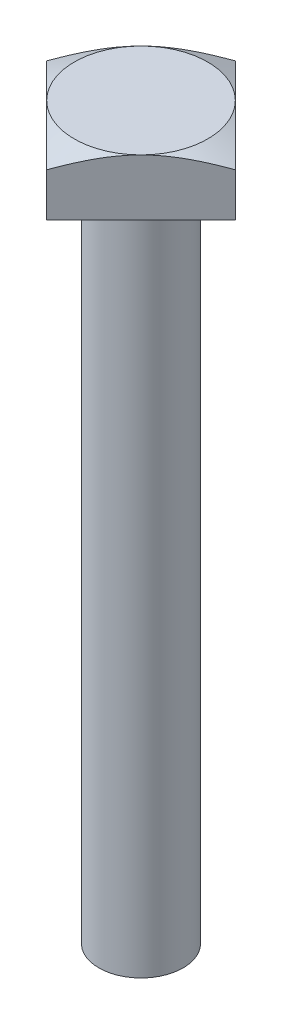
ISO-10303-21;
HEADER;
FILE_DESCRIPTION(('STEP AP214'),'2;1');
FILE_NAME('part.step','',(''),(''),'','','');
FILE_SCHEMA(('AUTOMOTIVE_DESIGN { 1 0 10303 214 1 1 1 1 }'));
ENDSEC;
DATA;
#1=APPLICATION_CONTEXT('core data for automotive mechanical design processes');
#2=APPLICATION_PROTOCOL_DEFINITION('international standard','automotive_design',2000,#1);
#3=PRODUCT_CONTEXT('',#1,'mechanical');
#4=PRODUCT('Part','Part','',(#3));
#5=PRODUCT_RELATED_PRODUCT_CATEGORY('part','',(#4));
#6=PRODUCT_DEFINITION_FORMATION('','',#4);
#7=PRODUCT_DEFINITION_CONTEXT('part definition',#1,'design');
#8=PRODUCT_DEFINITION('design','',#6,#7);
#9=PRODUCT_DEFINITION_SHAPE('','',#8);
#10=(LENGTH_UNIT() NAMED_UNIT(*) SI_UNIT(.MILLI.,.METRE.));
#11=(NAMED_UNIT(*) PLANE_ANGLE_UNIT() SI_UNIT($,.RADIAN.));
#12=(NAMED_UNIT(*) SI_UNIT($,.STERADIAN.) SOLID_ANGLE_UNIT());
#13=UNCERTAINTY_MEASURE_WITH_UNIT(LENGTH_MEASURE(1.E-05),#10,'distance_accuracy_value','');
#14=(GEOMETRIC_REPRESENTATION_CONTEXT(3) GLOBAL_UNCERTAINTY_ASSIGNED_CONTEXT((#13)) GLOBAL_UNIT_ASSIGNED_CONTEXT((#10,
#11,#12)) REPRESENTATION_CONTEXT('',''));
#15=CARTESIAN_POINT('',(0.,0.,0.));
#16=DIRECTION('',(0.,0.,1.));
#17=DIRECTION('',(1.,0.,0.));
#18=AXIS2_PLACEMENT_3D('',#15,#16,#17);
#19=CARTESIAN_POINT('',(-6.71751442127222,8.,6.7175144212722));
#20=DIRECTION('',(0.707106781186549,0.,-0.707106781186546));
#21=DIRECTION('',(-0.707106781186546,0.,-0.707106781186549));
#22=AXIS2_PLACEMENT_3D('',#19,#20,#21);
#23=PLANE('',#22);
#24=CARTESIAN_POINT('',(-13.4352288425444,6.16497265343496,-0.000200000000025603));
#25=CARTESIAN_POINT('',(-13.3017456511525,6.22721514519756,0.13328319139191));
#26=CARTESIAN_POINT('',(-13.1680687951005,6.28862605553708,0.266960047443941));
#27=CARTESIAN_POINT('',(-12.9002922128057,6.40959600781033,0.534736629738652));
#28=CARTESIAN_POINT('',(-12.7661924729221,6.4691549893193,0.668836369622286));
#29=CARTESIAN_POINT('',(-12.3631160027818,6.64480969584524,1.07191283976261));
#30=CARTESIAN_POINT('',(-12.0934640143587,6.75783530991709,1.34156482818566));
#31=CARTESIAN_POINT('',(-11.5502282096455,6.97460002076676,1.88480063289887));
#32=CARTESIAN_POINT('',(-11.276630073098,7.07826774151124,2.15839876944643));
#33=CARTESIAN_POINT('',(-10.7272245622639,7.2730933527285,2.70780428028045));
#34=CARTESIAN_POINT('',(-10.4514174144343,7.36425250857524,2.98361142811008));
#35=CARTESIAN_POINT('',(-9.90722658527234,7.52846190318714,3.52780225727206));
#36=CARTESIAN_POINT('',(-9.63892271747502,7.60203602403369,3.79610612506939));
#37=CARTESIAN_POINT('',(-9.10026726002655,7.73247535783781,4.33476158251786));
#38=CARTESIAN_POINT('',(-8.82991568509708,7.78934069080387,4.60511315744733));
#39=CARTESIAN_POINT('',(-8.28845512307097,7.88372305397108,5.14657371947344));
#40=CARTESIAN_POINT('',(-8.01735201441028,7.92130650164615,5.41767682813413));
#41=CARTESIAN_POINT('',(-7.47409196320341,7.97550795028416,5.96093687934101));
#42=CARTESIAN_POINT('',(-7.20193505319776,7.99212659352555,6.23309378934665));
#43=CARTESIAN_POINT('',(-6.64035879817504,8.00381053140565,6.79467004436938));
#44=CARTESIAN_POINT('',(-6.35092398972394,7.9974633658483,7.08410485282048));
#45=CARTESIAN_POINT('',(-5.77283538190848,7.9604375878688,7.66219346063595));
#46=CARTESIAN_POINT('',(-5.48418162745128,7.92975760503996,7.95084721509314));
#47=CARTESIAN_POINT('',(-4.90745724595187,7.84576792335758,8.52757159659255));
#48=CARTESIAN_POINT('',(-4.61939289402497,7.79237355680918,8.81563594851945));
#49=CARTESIAN_POINT('',(-4.04548269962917,7.6657482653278,9.38954614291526));
#50=CARTESIAN_POINT('',(-3.75963689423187,7.59251700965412,9.67539194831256));
#51=CARTESIAN_POINT('',(-3.17940837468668,7.42618843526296,10.2556204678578));
#52=CARTESIAN_POINT('',(-2.88512085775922,7.33243463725,10.5499079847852));
#53=CARTESIAN_POINT('',(-2.29907698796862,7.13018858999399,11.1359518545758));
#54=CARTESIAN_POINT('',(-2.00732096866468,7.02169442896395,11.4277078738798));
#55=CARTESIAN_POINT('',(-1.42837159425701,6.79371107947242,12.0066572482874));
#56=CARTESIAN_POINT('',(-1.14116041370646,6.67431182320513,12.293868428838));
#57=CARTESIAN_POINT('',(-0.711956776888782,6.48819914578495,12.7230720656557));
#58=CARTESIAN_POINT('',(-0.569192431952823,6.42500891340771,12.8658364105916));
#59=CARTESIAN_POINT('',(-0.284145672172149,6.29651698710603,13.1508831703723));
#60=CARTESIAN_POINT('',(-0.141863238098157,6.23121537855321,13.2931656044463));
#61=CARTESIAN_POINT('',(0.00019999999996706,6.16497265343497,13.4352288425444));
#62=B_SPLINE_CURVE_WITH_KNOTS('',3,(#24,#25,#26,#27,#28,#29,#30,#31,#32,#33,#34,#35,#36,#37,#38,
#39,#40,#41,#42,#43,#44,#45,#46,#47,#48,#49,#50,#51,#52,#53,#54,#55,#56,#57,#58,#59,#60,#61),
.UNSPECIFIED.,.F.,.F.,(4,2,2,2,2,2,2,2,2,2,2,2,2,2,2,2,2,2,4),(0.,0.596307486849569,
1.19263440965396,2.38574409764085,3.58729682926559,4.78872792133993,5.94793047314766,
7.10712469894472,8.26229874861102,9.41743740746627,10.6447946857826,11.8722210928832,
13.1042633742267,14.3363261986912,15.6158392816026,16.8955184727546,18.1654616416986,
18.8001232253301,19.4347591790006),.UNSPECIFIED.);
#63=CARTESIAN_POINT('',(-13.4350288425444,6.16506591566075,0.));
#64=VERTEX_POINT('',#63);
#65=CARTESIAN_POINT('',(-6.71751442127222,8.,6.71751442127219));
#66=VERTEX_POINT('',#65);
#67=EDGE_CURVE('E98',#64,#66,#62,.T.);
#68=ORIENTED_EDGE('',*,*,#67,.F.);
#69=DIRECTION('',(0.,-1.,0.));
#70=VECTOR('',#69,1.);
#71=CARTESIAN_POINT('',(-13.4350288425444,8.,0.));
#72=LINE('',#71,#70);
#73=CARTESIAN_POINT('',(-13.4350288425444,0.,0.));
#74=VERTEX_POINT('',#73);
#75=EDGE_CURVE('E178',#64,#74,#72,.T.);
#76=ORIENTED_EDGE('',*,*,#75,.T.);
#77=DIRECTION('',(0.707106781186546,0.,0.707106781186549));
#78=VECTOR('',#77,1.);
#79=CARTESIAN_POINT('',(-6.71751442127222,0.,6.7175144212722));
#80=LINE('',#79,#78);
#81=CARTESIAN_POINT('',(0.,0.,13.4350288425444));
#82=VERTEX_POINT('',#81);
#83=EDGE_CURVE('E173',#74,#82,#80,.T.);
#84=ORIENTED_EDGE('',*,*,#83,.T.);
#85=DIRECTION('',(0.,-1.,0.));
#86=VECTOR('',#85,1.);
#87=CARTESIAN_POINT('',(0.,8.,13.4350288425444));
#88=LINE('',#87,#86);
#89=CARTESIAN_POINT('',(0.,6.16506591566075,13.4350288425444));
#90=VERTEX_POINT('',#89);
#91=EDGE_CURVE('E166',#90,#82,#88,.T.);
#92=ORIENTED_EDGE('',*,*,#91,.F.);
#93=EDGE_CURVE('E116',#66,#90,#62,.T.);
#94=ORIENTED_EDGE('',*,*,#93,.F.);
#95=EDGE_LOOP('',(#68,#76,#84,#92,#94));
#96=FACE_BOUND('',#95,.T.);
#97=ADVANCED_FACE('F39',(#96),#23,.F.);
#98=CARTESIAN_POINT('',(6.71751442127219,8.,6.71751442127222));
#99=DIRECTION('',(-0.707106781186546,0.,-0.707106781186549));
#100=DIRECTION('',(-0.707106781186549,0.,0.707106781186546));
#101=AXIS2_PLACEMENT_3D('',#98,#99,#100);
#102=PLANE('',#101);
#103=CARTESIAN_POINT('',(-0.000200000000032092,6.16497265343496,13.4352288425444));
#104=CARTESIAN_POINT('',(0.133283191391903,6.22721514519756,13.3017456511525));
#105=CARTESIAN_POINT('',(0.266960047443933,6.28862605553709,13.1680687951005));
#106=CARTESIAN_POINT('',(0.534736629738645,6.40959600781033,12.9002922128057));
#107=CARTESIAN_POINT('',(0.66883636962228,6.4691549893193,12.7661924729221));
#108=CARTESIAN_POINT('',(1.0719128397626,6.64480969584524,12.3631160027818));
#109=CARTESIAN_POINT('',(1.34156482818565,6.75783530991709,12.0934640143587));
#110=CARTESIAN_POINT('',(1.88480063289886,6.97460002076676,11.5502282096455));
#111=CARTESIAN_POINT('',(2.15839876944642,7.07826774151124,11.276630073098));
#112=CARTESIAN_POINT('',(2.70780428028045,7.2730933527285,10.7272245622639));
#113=CARTESIAN_POINT('',(2.98361142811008,7.36425250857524,10.4514174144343));
#114=CARTESIAN_POINT('',(3.52780225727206,7.52846190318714,9.90722658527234));
#115=CARTESIAN_POINT('',(3.79610612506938,7.60203602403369,9.63892271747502));
#116=CARTESIAN_POINT('',(4.33476158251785,7.73247535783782,9.10026726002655));
#117=CARTESIAN_POINT('',(4.60511315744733,7.78934069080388,8.82991568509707));
#118=CARTESIAN_POINT('',(5.14657371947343,7.88372305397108,8.28845512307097));
#119=CARTESIAN_POINT('',(5.41767682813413,7.92130650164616,8.01735201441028));
#120=CARTESIAN_POINT('',(5.960936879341,7.97550795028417,7.47409196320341));
#121=CARTESIAN_POINT('',(6.23309378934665,7.99212659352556,7.20193505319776));
#122=CARTESIAN_POINT('',(6.79467004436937,8.00381053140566,6.64035879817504));
#123=CARTESIAN_POINT('',(7.08410485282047,7.99746336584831,6.35092398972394));
#124=CARTESIAN_POINT('',(7.66219346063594,7.9604375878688,5.77283538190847));
#125=CARTESIAN_POINT('',(7.95084721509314,7.92975760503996,5.48418162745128));
#126=CARTESIAN_POINT('',(8.52757159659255,7.84576792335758,4.90745724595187));
#127=CARTESIAN_POINT('',(8.81563594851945,7.79237355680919,4.61939289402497));
#128=CARTESIAN_POINT('',(9.38954614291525,7.66574826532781,4.04548269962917));
#129=CARTESIAN_POINT('',(9.67539194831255,7.59251700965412,3.75963689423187));
#130=CARTESIAN_POINT('',(10.2556204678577,7.42618843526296,3.17940837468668));
#131=CARTESIAN_POINT('',(10.5499079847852,7.33243463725,2.88512085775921));
#132=CARTESIAN_POINT('',(11.1359518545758,7.13018858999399,2.29907698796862));
#133=CARTESIAN_POINT('',(11.4277078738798,7.02169442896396,2.00732096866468));
#134=CARTESIAN_POINT('',(12.0066572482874,6.79371107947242,1.42837159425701));
#135=CARTESIAN_POINT('',(12.293868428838,6.67431182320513,1.14116041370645));
#136=CARTESIAN_POINT('',(12.7230720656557,6.48819914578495,0.711956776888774));
#137=CARTESIAN_POINT('',(12.8658364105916,6.42500891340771,0.569192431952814));
#138=CARTESIAN_POINT('',(13.1508831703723,6.29651698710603,0.284145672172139));
#139=CARTESIAN_POINT('',(13.2931656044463,6.2312153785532,0.141863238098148));
#140=CARTESIAN_POINT('',(13.4352288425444,6.16497265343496,-0.000199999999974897));
#141=B_SPLINE_CURVE_WITH_KNOTS('',3,(#103,#104,#105,#106,#107,#108,#109,#110,#111,#112,#113,
#114,#115,#116,#117,#118,#119,#120,#121,#122,#123,#124,#125,#126,#127,#128,#129,#130,#131,#132,
#133,#134,#135,#136,#137,#138,#139,#140),.UNSPECIFIED.,.F.,.F.,(4,2,2,2,2,2,2,2,2,2,2,2,2,2,2,2,
2,2,4),(0.,0.596307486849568,1.19263440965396,2.38574409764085,3.58729682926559,
4.78872792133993,5.94793047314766,7.10712469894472,8.26229874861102,9.41743740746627,
10.6447946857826,11.8722210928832,13.1042633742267,14.3363261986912,15.6158392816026,
16.8955184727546,18.1654616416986,18.8001232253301,19.4347591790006),.UNSPECIFIED.);
#142=CARTESIAN_POINT('',(6.71751442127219,8.,6.71751442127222));
#143=VERTEX_POINT('',#142);
#144=EDGE_CURVE('E150',#90,#143,#141,.T.);
#145=ORIENTED_EDGE('',*,*,#144,.F.);
#146=ORIENTED_EDGE('',*,*,#91,.T.);
#147=DIRECTION('',(0.707106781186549,0.,-0.707106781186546));
#148=VECTOR('',#147,1.);
#149=CARTESIAN_POINT('',(6.71751442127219,0.,6.71751442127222));
#150=LINE('',#149,#148);
#151=CARTESIAN_POINT('',(13.4350288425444,0.,0.));
#152=VERTEX_POINT('',#151);
#153=EDGE_CURVE('E186',#82,#152,#150,.T.);
#154=ORIENTED_EDGE('',*,*,#153,.T.);
#155=DIRECTION('',(0.,-1.,0.));
#156=VECTOR('',#155,1.);
#157=CARTESIAN_POINT('',(13.4350288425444,8.,0.));
#158=LINE('',#157,#156);
#159=CARTESIAN_POINT('',(13.4350288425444,6.16506591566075,0.));
#160=VERTEX_POINT('',#159);
#161=EDGE_CURVE('E174',#160,#152,#158,.T.);
#162=ORIENTED_EDGE('',*,*,#161,.F.);
#163=EDGE_CURVE('E95',#143,#160,#141,.T.);
#164=ORIENTED_EDGE('',*,*,#163,.F.);
#165=EDGE_LOOP('',(#145,#146,#154,#162,#164));
#166=FACE_BOUND('',#165,.T.);
#167=ADVANCED_FACE('F153',(#166),#102,.F.);
#168=CARTESIAN_POINT('',(6.7175144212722,8.,-6.7175144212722));
#169=DIRECTION('',(0.707106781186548,0.,-0.707106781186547));
#170=DIRECTION('',(-0.707106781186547,0.,-0.707106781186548));
#171=AXIS2_PLACEMENT_3D('',#168,#169,#170);
#172=PLANE('',#171);
#173=DIRECTION('',(0.,-1.,0.));
#174=VECTOR('',#173,1.);
#175=CARTESIAN_POINT('',(0.,8.,-13.4350288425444));
#176=LINE('',#175,#174);
#177=CARTESIAN_POINT('',(0.,6.16506591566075,-13.4350288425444));
#178=VERTEX_POINT('',#177);
#179=CARTESIAN_POINT('',(0.,0.,-13.4350288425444));
#180=VERTEX_POINT('',#179);
#181=EDGE_CURVE('E113',#178,#180,#176,.T.);
#182=ORIENTED_EDGE('',*,*,#181,.F.);
#183=CARTESIAN_POINT('',(-0.0002,6.16497265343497,-13.4352288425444));
#184=CARTESIAN_POINT('',(0.133283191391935,6.22721514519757,-13.3017456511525));
#185=CARTESIAN_POINT('',(0.266960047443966,6.28862605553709,-13.1680687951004));
#186=CARTESIAN_POINT('',(0.534736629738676,6.40959600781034,-12.9002922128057));
#187=CARTESIAN_POINT('',(0.66883636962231,6.46915498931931,-12.7661924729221));
#188=CARTESIAN_POINT('',(1.07191283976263,6.64480969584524,-12.3631160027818));
#189=CARTESIAN_POINT('',(1.34156482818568,6.75783530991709,-12.0934640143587));
#190=CARTESIAN_POINT('',(1.88480063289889,6.97460002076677,-11.5502282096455));
#191=CARTESIAN_POINT('',(2.15839876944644,7.07826774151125,-11.276630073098));
#192=CARTESIAN_POINT('',(2.70780428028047,7.2730933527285,-10.7272245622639));
#193=CARTESIAN_POINT('',(2.9836114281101,7.36425250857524,-10.4514174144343));
#194=CARTESIAN_POINT('',(3.52780225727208,7.52846190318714,-9.90722658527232));
#195=CARTESIAN_POINT('',(3.7961061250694,7.6020360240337,-9.638922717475));
#196=CARTESIAN_POINT('',(4.33476158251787,7.73247535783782,-9.10026726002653));
#197=CARTESIAN_POINT('',(4.60511315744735,7.78934069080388,-8.82991568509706));
#198=CARTESIAN_POINT('',(5.14657371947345,7.88372305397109,-8.28845512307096));
#199=CARTESIAN_POINT('',(5.41767682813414,7.92130650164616,-8.01735201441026));
#200=CARTESIAN_POINT('',(5.96093687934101,7.97550795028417,-7.47409196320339));
#201=CARTESIAN_POINT('',(6.23309378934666,7.99212659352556,-7.20193505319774));
#202=CARTESIAN_POINT('',(6.79467004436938,8.00381053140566,-6.64035879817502));
#203=CARTESIAN_POINT('',(7.08410485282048,7.99746336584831,-6.35092398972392));
#204=CARTESIAN_POINT('',(7.66219346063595,7.96043758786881,-5.77283538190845));
#205=CARTESIAN_POINT('',(7.95084721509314,7.92975760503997,-5.48418162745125));
#206=CARTESIAN_POINT('',(8.52757159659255,7.84576792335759,-4.90745724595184));
#207=CARTESIAN_POINT('',(8.81563594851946,7.79237355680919,-4.61939289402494));
#208=CARTESIAN_POINT('',(9.38954614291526,7.66574826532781,-4.04548269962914));
#209=CARTESIAN_POINT('',(9.67539194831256,7.59251700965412,-3.75963689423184));
#210=CARTESIAN_POINT('',(10.2556204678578,7.42618843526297,-3.17940837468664));
#211=CARTESIAN_POINT('',(10.5499079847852,7.33243463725,-2.88512085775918));
#212=CARTESIAN_POINT('',(11.1359518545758,7.13018858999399,-2.29907698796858));
#213=CARTESIAN_POINT('',(11.4277078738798,7.02169442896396,-2.00732096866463));
#214=CARTESIAN_POINT('',(12.0066572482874,6.79371107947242,-1.42837159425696));
#215=CARTESIAN_POINT('',(12.293868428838,6.67431182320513,-1.14116041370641));
#216=CARTESIAN_POINT('',(12.7230720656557,6.48819914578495,-0.711956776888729));
#217=CARTESIAN_POINT('',(12.8658364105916,6.42500891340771,-0.569192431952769));
#218=CARTESIAN_POINT('',(13.1508831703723,6.29651698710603,-0.284145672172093));
#219=CARTESIAN_POINT('',(13.2931656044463,6.2312153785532,-0.141863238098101));
#220=CARTESIAN_POINT('',(13.4352288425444,6.16497265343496,0.000200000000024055));
#221=B_SPLINE_CURVE_WITH_KNOTS('',3,(#183,#184,#185,#186,#187,#188,#189,#190,#191,#192,#193,
#194,#195,#196,#197,#198,#199,#200,#201,#202,#203,#204,#205,#206,#207,#208,#209,#210,#211,#212,
#213,#214,#215,#216,#217,#218,#219,#220),.UNSPECIFIED.,.F.,.F.,(4,2,2,2,2,2,2,2,2,2,2,2,2,2,2,2,
2,2,4),(0.,0.59630748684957,1.19263440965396,2.38574409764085,3.58729682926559,4.78872792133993,
5.94793047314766,7.10712469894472,8.26229874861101,9.41743740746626,10.6447946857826,
11.8722210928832,13.1042633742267,14.3363261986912,15.6158392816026,16.8955184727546,
18.1654616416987,18.8001232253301,19.4347591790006),.UNSPECIFIED.);
#222=CARTESIAN_POINT('',(6.71751442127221,8.,-6.7175144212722));
#223=VERTEX_POINT('',#222);
#224=EDGE_CURVE('E63',#178,#223,#221,.T.);
#225=ORIENTED_EDGE('',*,*,#224,.T.);
#226=EDGE_CURVE('E92',#223,#160,#221,.T.);
#227=ORIENTED_EDGE('',*,*,#226,.T.);
#228=ORIENTED_EDGE('',*,*,#161,.T.);
#229=DIRECTION('',(0.707106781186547,0.,0.707106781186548));
#230=VECTOR('',#229,1.);
#231=CARTESIAN_POINT('',(6.7175144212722,0.,-6.7175144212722));
#232=LINE('',#231,#230);
#233=EDGE_CURVE('E183',#180,#152,#232,.T.);
#234=ORIENTED_EDGE('',*,*,#233,.F.);
#235=EDGE_LOOP('',(#182,#225,#227,#228,#234));
#236=FACE_BOUND('',#235,.T.);
#237=ADVANCED_FACE('F111',(#236),#172,.T.);
#238=CARTESIAN_POINT('',(-6.7175144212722,8.,-6.71751442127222));
#239=DIRECTION('',(-0.707106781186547,0.,-0.707106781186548));
#240=DIRECTION('',(-0.707106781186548,0.,0.707106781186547));
#241=AXIS2_PLACEMENT_3D('',#238,#239,#240);
#242=PLANE('',#241);
#243=ORIENTED_EDGE('',*,*,#75,.F.);
#244=CARTESIAN_POINT('',(-13.4352288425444,6.16497265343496,0.000199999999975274));
#245=CARTESIAN_POINT('',(-13.3017456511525,6.22721514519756,-0.133283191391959));
#246=CARTESIAN_POINT('',(-13.1680687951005,6.28862605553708,-0.266960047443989));
#247=CARTESIAN_POINT('',(-12.9002922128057,6.40959600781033,-0.5347366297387));
#248=CARTESIAN_POINT('',(-12.7661924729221,6.4691549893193,-0.668836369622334));
#249=CARTESIAN_POINT('',(-12.3631160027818,6.64480969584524,-1.07191283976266));
#250=CARTESIAN_POINT('',(-12.0934640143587,6.75783530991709,-1.3415648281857));
#251=CARTESIAN_POINT('',(-11.5502282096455,6.97460002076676,-1.88480063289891));
#252=CARTESIAN_POINT('',(-11.276630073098,7.07826774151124,-2.15839876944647));
#253=CARTESIAN_POINT('',(-10.7272245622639,7.27309335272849,-2.7078042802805));
#254=CARTESIAN_POINT('',(-10.4514174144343,7.36425250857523,-2.98361142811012));
#255=CARTESIAN_POINT('',(-9.90722658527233,7.52846190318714,-3.5278022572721));
#256=CARTESIAN_POINT('',(-9.638922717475,7.60203602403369,-3.79610612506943));
#257=CARTESIAN_POINT('',(-9.10026726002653,7.73247535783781,-4.3347615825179));
#258=CARTESIAN_POINT('',(-8.82991568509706,7.78934069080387,-4.60511315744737));
#259=CARTESIAN_POINT('',(-8.28845512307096,7.88372305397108,-5.14657371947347));
#260=CARTESIAN_POINT('',(-8.01735201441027,7.92130650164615,-5.41767682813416));
#261=CARTESIAN_POINT('',(-7.47409196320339,7.97550795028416,-5.96093687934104));
#262=CARTESIAN_POINT('',(-7.20193505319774,7.99212659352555,-6.23309378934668));
#263=CARTESIAN_POINT('',(-6.64035879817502,8.00381053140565,-6.7946700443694));
#264=CARTESIAN_POINT('',(-6.35092398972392,7.9974633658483,-7.0841048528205));
#265=CARTESIAN_POINT('',(-5.77283538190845,7.9604375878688,-7.66219346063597));
#266=CARTESIAN_POINT('',(-5.48418162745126,7.92975760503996,-7.95084721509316));
#267=CARTESIAN_POINT('',(-4.90745724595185,7.84576792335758,-8.52757159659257));
#268=CARTESIAN_POINT('',(-4.61939289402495,7.79237355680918,-8.81563594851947));
#269=CARTESIAN_POINT('',(-4.04548269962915,7.6657482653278,-9.38954614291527));
#270=CARTESIAN_POINT('',(-3.75963689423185,7.59251700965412,-9.67539194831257));
#271=CARTESIAN_POINT('',(-3.17940837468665,7.42618843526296,-10.2556204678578));
#272=CARTESIAN_POINT('',(-2.88512085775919,7.33243463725,-10.5499079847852));
#273=CARTESIAN_POINT('',(-2.29907698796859,7.13018858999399,-11.1359518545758));
#274=CARTESIAN_POINT('',(-2.00732096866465,7.02169442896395,-11.4277078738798));
#275=CARTESIAN_POINT('',(-1.42837159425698,6.79371107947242,-12.0066572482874));
#276=CARTESIAN_POINT('',(-1.14116041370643,6.67431182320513,-12.293868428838));
#277=CARTESIAN_POINT('',(-0.711956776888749,6.48819914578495,-12.7230720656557));
#278=CARTESIAN_POINT('',(-0.569192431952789,6.42500891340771,-12.8658364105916));
#279=CARTESIAN_POINT('',(-0.284145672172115,6.29651698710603,-13.1508831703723));
#280=CARTESIAN_POINT('',(-0.141863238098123,6.23121537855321,-13.2931656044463));
#281=CARTESIAN_POINT('',(0.000200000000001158,6.16497265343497,-13.4352288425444));
#282=B_SPLINE_CURVE_WITH_KNOTS('',3,(#244,#245,#246,#247,#248,#249,#250,#251,#252,#253,#254,
#255,#256,#257,#258,#259,#260,#261,#262,#263,#264,#265,#266,#267,#268,#269,#270,#271,#272,#273,
#274,#275,#276,#277,#278,#279,#280,#281),.UNSPECIFIED.,.F.,.F.,(4,2,2,2,2,2,2,2,2,2,2,2,2,2,2,2,
2,2,4),(0.,0.596307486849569,1.19263440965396,2.38574409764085,3.58729682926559,
4.78872792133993,5.94793047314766,7.10712469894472,8.26229874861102,9.41743740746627,
10.6447946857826,11.8722210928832,13.1042633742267,14.3363261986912,15.6158392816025,
16.8955184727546,18.1654616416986,18.8001232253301,19.4347591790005),.UNSPECIFIED.);
#283=CARTESIAN_POINT('',(-6.71751442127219,8.,-6.71751442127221));
#284=VERTEX_POINT('',#283);
#285=EDGE_CURVE('E114',#64,#284,#282,.T.);
#286=ORIENTED_EDGE('',*,*,#285,.T.);
#287=EDGE_CURVE('E101',#284,#178,#282,.T.);
#288=ORIENTED_EDGE('',*,*,#287,.T.);
#289=ORIENTED_EDGE('',*,*,#181,.T.);
#290=DIRECTION('',(0.707106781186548,0.,-0.707106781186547));
#291=VECTOR('',#290,1.);
#292=CARTESIAN_POINT('',(-6.7175144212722,0.,-6.71751442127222));
#293=LINE('',#292,#291);
#294=EDGE_CURVE('E180',#74,#180,#293,.T.);
#295=ORIENTED_EDGE('',*,*,#294,.F.);
#296=EDGE_LOOP('',(#243,#286,#288,#289,#295));
#297=FACE_BOUND('',#296,.T.);
#298=ADVANCED_FACE('F161',(#297),#242,.T.);
#299=CARTESIAN_POINT('',(0.,0.,0.));
#300=DIRECTION('',(0.,1.,0.));
#301=DIRECTION('',(0.,0.,1.));
#302=AXIS2_PLACEMENT_3D('',#299,#300,#301);
#303=PLANE('',#302);
#304=CARTESIAN_POINT('',(0.,0.,0.));
#305=DIRECTION('',(0.,1.,0.));
#306=DIRECTION('',(0.,0.,1.));
#307=AXIS2_PLACEMENT_3D('',#304,#305,#306);
#308=CIRCLE('',#307,6.);
#309=CARTESIAN_POINT('',(0.,0.,6.));
#310=VERTEX_POINT('',#309);
#311=EDGE_CURVE('E188',#310,#310,#308,.T.);
#312=ORIENTED_EDGE('',*,*,#311,.T.);
#313=EDGE_LOOP('',(#312));
#314=FACE_BOUND('',#313,.T.);
#315=ORIENTED_EDGE('',*,*,#83,.F.);
#316=ORIENTED_EDGE('',*,*,#294,.T.);
#317=ORIENTED_EDGE('',*,*,#233,.T.);
#318=ORIENTED_EDGE('',*,*,#153,.F.);
#319=EDGE_LOOP('',(#315,#316,#317,#318));
#320=FACE_BOUND('',#319,.T.);
#321=ADVANCED_FACE('F198',(#314,#320),#303,.F.);
#322=CARTESIAN_POINT('',(0.,-96.,0.));
#323=DIRECTION('',(0.,1.,0.));
#324=DIRECTION('',(0.,0.,1.));
#325=AXIS2_PLACEMENT_3D('',#322,#323,#324);
#326=CYLINDRICAL_SURFACE('',#325,6.);
#327=CARTESIAN_POINT('',(0.,-96.,0.));
#328=DIRECTION('',(0.,1.,0.));
#329=DIRECTION('',(0.,0.,1.));
#330=AXIS2_PLACEMENT_3D('',#327,#328,#329);
#331=CIRCLE('',#330,6.);
#332=CARTESIAN_POINT('',(0.,-96.,6.));
#333=VERTEX_POINT('',#332);
#334=EDGE_CURVE('E151',#333,#333,#331,.T.);
#335=ORIENTED_EDGE('',*,*,#334,.T.);
#336=EDGE_LOOP('',(#335));
#337=FACE_BOUND('',#336,.T.);
#338=ORIENTED_EDGE('',*,*,#311,.F.);
#339=EDGE_LOOP('',(#338));
#340=FACE_BOUND('',#339,.T.);
#341=ADVANCED_FACE('F200',(#337,#340),#326,.T.);
#342=CARTESIAN_POINT('',(0.,-96.,0.));
#343=DIRECTION('',(0.,1.,0.));
#344=DIRECTION('',(0.,0.,1.));
#345=AXIS2_PLACEMENT_3D('',#342,#343,#344);
#346=PLANE('',#345);
#347=ORIENTED_EDGE('',*,*,#334,.F.);
#348=EDGE_LOOP('',(#347));
#349=FACE_BOUND('',#348,.T.);
#350=ADVANCED_FACE('F140',(#349),#346,.F.);
#351=CARTESIAN_POINT('',(0.,8.,0.));
#352=DIRECTION('',(0.,-1.,0.));
#353=DIRECTION('',(0.,0.,1.));
#354=AXIS2_PLACEMENT_3D('',#351,#352,#353);
#355=CONICAL_SURFACE('',#354,9.5,1.13446401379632);
#356=ORIENTED_EDGE('',*,*,#93,.T.);
#357=ORIENTED_EDGE('',*,*,#144,.T.);
#358=CARTESIAN_POINT('',(0.,8.,0.));
#359=DIRECTION('',(0.,1.,0.));
#360=DIRECTION('',(0.,0.,1.));
#361=AXIS2_PLACEMENT_3D('',#358,#359,#360);
#362=CIRCLE('',#361,9.5);
#363=EDGE_CURVE('E43',#66,#143,#362,.T.);
#364=ORIENTED_EDGE('',*,*,#363,.F.);
#365=EDGE_LOOP('',(#356,#357,#364));
#366=FACE_BOUND('',#365,.T.);
#367=ADVANCED_FACE('F139',(#366),#355,.T.);
#368=ORIENTED_EDGE('',*,*,#67,.T.);
#369=EDGE_CURVE('E48',#284,#66,#362,.T.);
#370=ORIENTED_EDGE('',*,*,#369,.F.);
#371=ORIENTED_EDGE('',*,*,#285,.F.);
#372=EDGE_LOOP('',(#368,#370,#371));
#373=FACE_BOUND('',#372,.T.);
#374=ADVANCED_FACE('F138',(#373),#355,.T.);
#375=ORIENTED_EDGE('',*,*,#287,.F.);
#376=EDGE_CURVE('E12',#223,#284,#362,.T.);
#377=ORIENTED_EDGE('',*,*,#376,.F.);
#378=ORIENTED_EDGE('',*,*,#224,.F.);
#379=EDGE_LOOP('',(#375,#377,#378));
#380=FACE_BOUND('',#379,.T.);
#381=ADVANCED_FACE('F100',(#380),#355,.T.);
#382=ORIENTED_EDGE('',*,*,#163,.T.);
#383=ORIENTED_EDGE('',*,*,#226,.F.);
#384=CARTESIAN_POINT('',(0.,8.,0.));
#385=DIRECTION('',(0.,1.,0.));
#386=DIRECTION('',(0.,0.,1.));
#387=AXIS2_PLACEMENT_3D('',#384,#385,#386);
#388=CIRCLE('',#387,9.5);
#389=EDGE_CURVE('E55',#143,#223,#388,.T.);
#390=ORIENTED_EDGE('',*,*,#389,.F.);
#391=EDGE_LOOP('',(#382,#383,#390));
#392=FACE_BOUND('',#391,.T.);
#393=ADVANCED_FACE('F93',(#392),#355,.T.);
#394=CARTESIAN_POINT('',(0.,8.,0.));
#395=DIRECTION('',(0.,1.,0.));
#396=DIRECTION('',(0.,0.,1.));
#397=AXIS2_PLACEMENT_3D('',#394,#395,#396);
#398=PLANE('',#397);
#399=ORIENTED_EDGE('',*,*,#363,.T.);
#400=ORIENTED_EDGE('',*,*,#389,.T.);
#401=ORIENTED_EDGE('',*,*,#376,.T.);
#402=ORIENTED_EDGE('',*,*,#369,.T.);
#403=EDGE_LOOP('',(#399,#400,#401,#402));
#404=FACE_BOUND('',#403,.T.);
#405=ADVANCED_FACE('F107',(#404),#398,.T.);
#406=CLOSED_SHELL('',(#97,#167,#237,#298,#321,#341,#350,#367,#374,#381,#393,#405));
#407=MANIFOLD_SOLID_BREP('B2',#406);
#408=ADVANCED_BREP_SHAPE_REPRESENTATION('',(#18,#407),#14);
#409=SHAPE_DEFINITION_REPRESENTATION(#9,#408);
ENDSEC;
END-ISO-10303-21;
